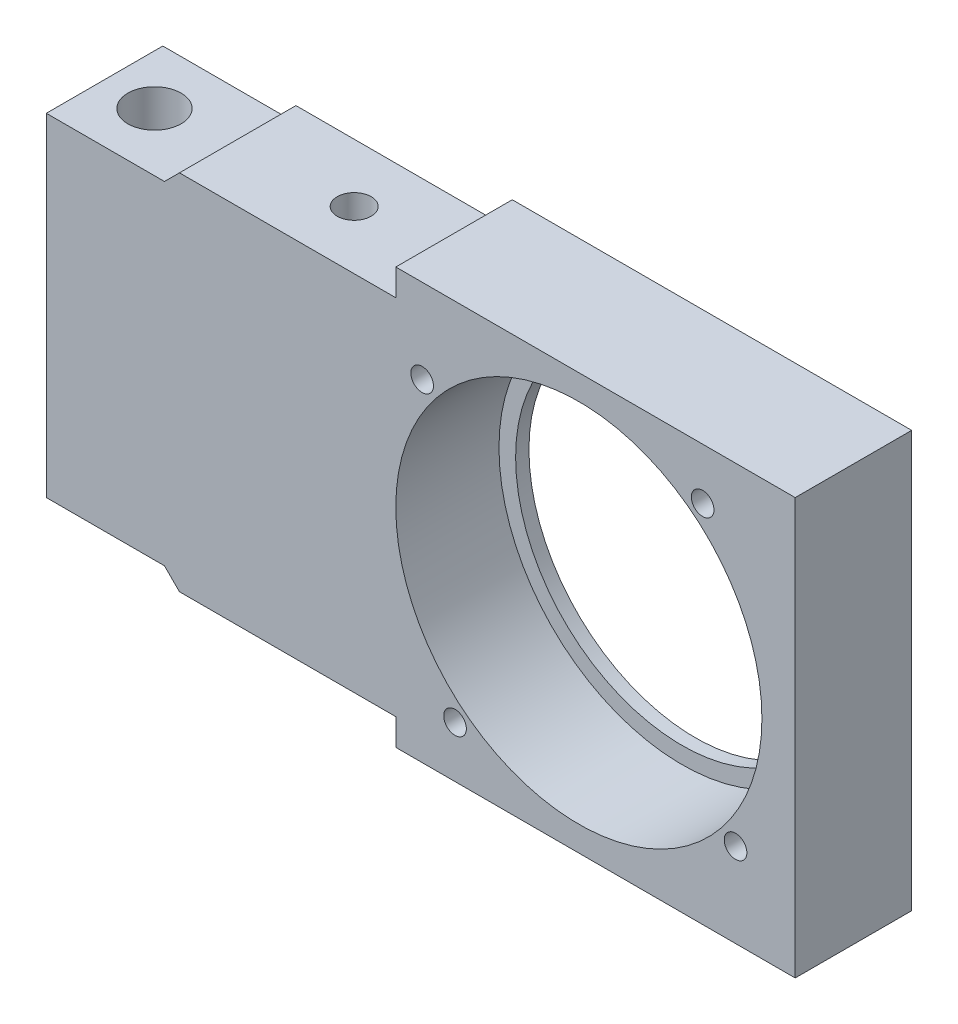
ISO-10303-21;
HEADER;
FILE_DESCRIPTION(('STEP AP214'),'2;1');
FILE_NAME('part.step','',(''),(''),'','','');
FILE_SCHEMA(('AUTOMOTIVE_DESIGN { 1 0 10303 214 1 1 1 1 }'));
ENDSEC;
DATA;
#1=APPLICATION_CONTEXT('core data for automotive mechanical design processes');
#2=APPLICATION_PROTOCOL_DEFINITION('international standard','automotive_design',2000,#1);
#3=PRODUCT_CONTEXT('',#1,'mechanical');
#4=PRODUCT('Part','Part','',(#3));
#5=PRODUCT_RELATED_PRODUCT_CATEGORY('part','',(#4));
#6=PRODUCT_DEFINITION_FORMATION('','',#4);
#7=PRODUCT_DEFINITION_CONTEXT('part definition',#1,'design');
#8=PRODUCT_DEFINITION('design','',#6,#7);
#9=PRODUCT_DEFINITION_SHAPE('','',#8);
#10=(LENGTH_UNIT() NAMED_UNIT(*) SI_UNIT(.MILLI.,.METRE.));
#11=(NAMED_UNIT(*) PLANE_ANGLE_UNIT() SI_UNIT($,.RADIAN.));
#12=(NAMED_UNIT(*) SI_UNIT($,.STERADIAN.) SOLID_ANGLE_UNIT());
#13=UNCERTAINTY_MEASURE_WITH_UNIT(LENGTH_MEASURE(1.E-05),#10,'distance_accuracy_value','');
#14=(GEOMETRIC_REPRESENTATION_CONTEXT(3) GLOBAL_UNCERTAINTY_ASSIGNED_CONTEXT((#13)) GLOBAL_UNIT_ASSIGNED_CONTEXT((#10,
#11,#12)) REPRESENTATION_CONTEXT('',''));
#15=CARTESIAN_POINT('',(0.,0.,0.));
#16=DIRECTION('',(0.,0.,1.));
#17=DIRECTION('',(1.,0.,0.));
#18=AXIS2_PLACEMENT_3D('',#15,#16,#17);
#19=CARTESIAN_POINT('',(-174.5,1.66533453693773E-13,17.5));
#20=DIRECTION('',(0.,0.,1.));
#21=DIRECTION('',(1.,0.,0.));
#22=AXIS2_PLACEMENT_3D('',#19,#20,#21);
#23=PLANE('',#22);
#24=CARTESIAN_POINT('',(37.195451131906,47.0797027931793,17.5));
#25=DIRECTION('',(0.,0.,1.));
#26=DIRECTION('',(1.,0.,0.));
#27=AXIS2_PLACEMENT_3D('',#24,#25,#26);
#28=CIRCLE('',#27,3.39999999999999);
#29=CARTESIAN_POINT('',(40.595451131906,47.0797027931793,17.5));
#30=VERTEX_POINT('',#29);
#31=EDGE_CURVE('E147',#30,#30,#28,.T.);
#32=ORIENTED_EDGE('',*,*,#31,.F.);
#33=EDGE_LOOP('',(#32));
#34=FACE_BOUND('',#33,.T.);
#35=CARTESIAN_POINT('',(47.0797027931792,-37.1954511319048,17.5));
#36=DIRECTION('',(0.,0.,1.));
#37=DIRECTION('',(1.,0.,0.));
#38=AXIS2_PLACEMENT_3D('',#35,#36,#37);
#39=CIRCLE('',#38,3.39999999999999);
#40=CARTESIAN_POINT('',(50.4797027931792,-37.1954511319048,17.5));
#41=VERTEX_POINT('',#40);
#42=EDGE_CURVE('E155',#41,#41,#39,.T.);
#43=ORIENTED_EDGE('',*,*,#42,.F.);
#44=EDGE_LOOP('',(#43));
#45=FACE_BOUND('',#44,.T.);
#46=CARTESIAN_POINT('',(-37.1954511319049,-47.079702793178,17.5));
#47=DIRECTION('',(0.,0.,1.));
#48=DIRECTION('',(1.,0.,0.));
#49=AXIS2_PLACEMENT_3D('',#46,#47,#48);
#50=CIRCLE('',#49,3.39999999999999);
#51=CARTESIAN_POINT('',(-33.7954511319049,-47.079702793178,17.5));
#52=VERTEX_POINT('',#51);
#53=EDGE_CURVE('E161',#52,#52,#50,.T.);
#54=ORIENTED_EDGE('',*,*,#53,.F.);
#55=EDGE_LOOP('',(#54));
#56=FACE_BOUND('',#55,.T.);
#57=CARTESIAN_POINT('',(-47.0797027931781,37.1954511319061,17.5));
#58=DIRECTION('',(0.,0.,1.));
#59=DIRECTION('',(1.,0.,0.));
#60=AXIS2_PLACEMENT_3D('',#57,#58,#59);
#61=CIRCLE('',#60,3.39999999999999);
#62=CARTESIAN_POINT('',(-43.6797027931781,37.1954511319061,17.5));
#63=VERTEX_POINT('',#62);
#64=EDGE_CURVE('E167',#63,#63,#61,.T.);
#65=ORIENTED_EDGE('',*,*,#64,.F.);
#66=EDGE_LOOP('',(#65));
#67=FACE_BOUND('',#66,.T.);
#68=DIRECTION('',(0.707106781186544,-0.707106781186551,0.));
#69=VECTOR('',#68,1.);
#70=CARTESIAN_POINT('',(-120.,-54.5,17.5));
#71=LINE('',#70,#69);
#72=CARTESIAN_POINT('',(-124.5,-50.,17.5));
#73=VERTEX_POINT('',#72);
#74=CARTESIAN_POINT('',(-120.,-54.5,17.5));
#75=VERTEX_POINT('',#74);
#76=EDGE_CURVE('E212',#73,#75,#71,.T.);
#77=ORIENTED_EDGE('',*,*,#76,.T.);
#78=DIRECTION('',(1.,0.,0.));
#79=VECTOR('',#78,1.);
#80=CARTESIAN_POINT('',(-55.,-54.5,17.5));
#81=LINE('',#80,#79);
#82=CARTESIAN_POINT('',(-55.,-54.5,17.5));
#83=VERTEX_POINT('',#82);
#84=EDGE_CURVE('E214',#75,#83,#81,.T.);
#85=ORIENTED_EDGE('',*,*,#84,.T.);
#86=DIRECTION('',(0.,-1.,0.));
#87=VECTOR('',#86,1.);
#88=CARTESIAN_POINT('',(-55.,-62.5,17.5));
#89=LINE('',#88,#87);
#90=CARTESIAN_POINT('',(-55.,-62.5,17.5));
#91=VERTEX_POINT('',#90);
#92=EDGE_CURVE('E216',#83,#91,#89,.T.);
#93=ORIENTED_EDGE('',*,*,#92,.T.);
#94=DIRECTION('',(1.,0.,0.));
#95=VECTOR('',#94,1.);
#96=CARTESIAN_POINT('',(65.,-62.5,17.5));
#97=LINE('',#96,#95);
#98=CARTESIAN_POINT('',(65.,-62.5,17.5));
#99=VERTEX_POINT('',#98);
#100=EDGE_CURVE('E218',#91,#99,#97,.T.);
#101=ORIENTED_EDGE('',*,*,#100,.T.);
#102=DIRECTION('',(0.,1.,0.));
#103=VECTOR('',#102,1.);
#104=CARTESIAN_POINT('',(65.,-62.5,17.5));
#105=LINE('',#104,#103);
#106=CARTESIAN_POINT('',(65.,62.5,17.5));
#107=VERTEX_POINT('',#106);
#108=EDGE_CURVE('E220',#99,#107,#105,.T.);
#109=ORIENTED_EDGE('',*,*,#108,.T.);
#110=DIRECTION('',(-1.,0.,0.));
#111=VECTOR('',#110,1.);
#112=CARTESIAN_POINT('',(65.,62.5,17.5));
#113=LINE('',#112,#111);
#114=CARTESIAN_POINT('',(-55.,62.5,17.5));
#115=VERTEX_POINT('',#114);
#116=EDGE_CURVE('E222',#107,#115,#113,.T.);
#117=ORIENTED_EDGE('',*,*,#116,.T.);
#118=DIRECTION('',(0.,-1.,0.));
#119=VECTOR('',#118,1.);
#120=CARTESIAN_POINT('',(-55.,62.5,17.5));
#121=LINE('',#120,#119);
#122=CARTESIAN_POINT('',(-55.,54.5,17.5));
#123=VERTEX_POINT('',#122);
#124=EDGE_CURVE('E224',#115,#123,#121,.T.);
#125=ORIENTED_EDGE('',*,*,#124,.T.);
#126=DIRECTION('',(-1.,0.,0.));
#127=VECTOR('',#126,1.);
#128=CARTESIAN_POINT('',(-55.,54.5,17.5));
#129=LINE('',#128,#127);
#130=CARTESIAN_POINT('',(-120.,54.5,17.5));
#131=VERTEX_POINT('',#130);
#132=EDGE_CURVE('E226',#123,#131,#129,.T.);
#133=ORIENTED_EDGE('',*,*,#132,.T.);
#134=DIRECTION('',(-0.707106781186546,-0.707106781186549,0.));
#135=VECTOR('',#134,1.);
#136=CARTESIAN_POINT('',(-120.,54.5,17.5));
#137=LINE('',#136,#135);
#138=CARTESIAN_POINT('',(-124.5,50.,17.5));
#139=VERTEX_POINT('',#138);
#140=EDGE_CURVE('E228',#131,#139,#137,.T.);
#141=ORIENTED_EDGE('',*,*,#140,.T.);
#142=DIRECTION('',(-1.,0.,0.));
#143=VECTOR('',#142,1.);
#144=CARTESIAN_POINT('',(-124.5,50.,17.5));
#145=LINE('',#144,#143);
#146=CARTESIAN_POINT('',(-160.,50.,17.5));
#147=VERTEX_POINT('',#146);
#148=EDGE_CURVE('E230',#139,#147,#145,.T.);
#149=ORIENTED_EDGE('',*,*,#148,.T.);
#150=DIRECTION('',(0.,-1.,0.));
#151=VECTOR('',#150,1.);
#152=CARTESIAN_POINT('',(-160.,50.,17.5));
#153=LINE('',#152,#151);
#154=CARTESIAN_POINT('',(-160.,-50.,17.5));
#155=VERTEX_POINT('',#154);
#156=EDGE_CURVE('E56',#147,#155,#153,.T.);
#157=ORIENTED_EDGE('',*,*,#156,.T.);
#158=DIRECTION('',(1.,0.,0.));
#159=VECTOR('',#158,1.);
#160=CARTESIAN_POINT('',(-124.5,-50.,17.5));
#161=LINE('',#160,#159);
#162=EDGE_CURVE('E51',#155,#73,#161,.T.);
#163=ORIENTED_EDGE('',*,*,#162,.T.);
#164=EDGE_LOOP('',(#77,#85,#93,#101,#109,#117,#125,#133,#141,#149,#157,#163));
#165=FACE_BOUND('',#164,.T.);
#166=CARTESIAN_POINT('',(0.,0.,17.5));
#167=DIRECTION('',(0.,0.,1.));
#168=DIRECTION('',(1.,0.,0.));
#169=AXIS2_PLACEMENT_3D('',#166,#167,#168);
#170=CIRCLE('',#169,55.);
#171=CARTESIAN_POINT('',(55.,0.,17.5));
#172=VERTEX_POINT('',#171);
#173=EDGE_CURVE('E190',#172,#172,#170,.F.);
#174=ORIENTED_EDGE('',*,*,#173,.T.);
#175=EDGE_LOOP('',(#174));
#176=FACE_BOUND('',#175,.T.);
#177=ADVANCED_FACE('F34',(#34,#45,#56,#67,#165,#176),#23,.T.);
#178=CARTESIAN_POINT('',(-174.5,1.66533453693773E-13,-17.5));
#179=DIRECTION('',(0.,0.,1.));
#180=DIRECTION('',(1.,0.,0.));
#181=AXIS2_PLACEMENT_3D('',#178,#179,#180);
#182=PLANE('',#181);
#183=DIRECTION('',(0.707106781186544,-0.707106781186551,0.));
#184=VECTOR('',#183,1.);
#185=CARTESIAN_POINT('',(-120.,-54.5,-17.5));
#186=LINE('',#185,#184);
#187=CARTESIAN_POINT('',(-124.5,-50.,-17.5));
#188=VERTEX_POINT('',#187);
#189=CARTESIAN_POINT('',(-120.,-54.5,-17.5));
#190=VERTEX_POINT('',#189);
#191=EDGE_CURVE('E186',#188,#190,#186,.T.);
#192=ORIENTED_EDGE('',*,*,#191,.F.);
#193=DIRECTION('',(1.,0.,0.));
#194=VECTOR('',#193,1.);
#195=CARTESIAN_POINT('',(-124.5,-50.,-17.5));
#196=LINE('',#195,#194);
#197=CARTESIAN_POINT('',(-160.,-50.,-17.5));
#198=VERTEX_POINT('',#197);
#199=EDGE_CURVE('E210',#198,#188,#196,.T.);
#200=ORIENTED_EDGE('',*,*,#199,.F.);
#201=DIRECTION('',(0.,-1.,0.));
#202=VECTOR('',#201,1.);
#203=CARTESIAN_POINT('',(-160.,50.,-17.5));
#204=LINE('',#203,#202);
#205=CARTESIAN_POINT('',(-160.,50.,-17.5));
#206=VERTEX_POINT('',#205);
#207=EDGE_CURVE('E208',#206,#198,#204,.T.);
#208=ORIENTED_EDGE('',*,*,#207,.F.);
#209=DIRECTION('',(-1.,0.,0.));
#210=VECTOR('',#209,1.);
#211=CARTESIAN_POINT('',(-124.5,50.,-17.5));
#212=LINE('',#211,#210);
#213=CARTESIAN_POINT('',(-124.5,50.,-17.5));
#214=VERTEX_POINT('',#213);
#215=EDGE_CURVE('E206',#214,#206,#212,.T.);
#216=ORIENTED_EDGE('',*,*,#215,.F.);
#217=DIRECTION('',(-0.707106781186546,-0.707106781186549,0.));
#218=VECTOR('',#217,1.);
#219=CARTESIAN_POINT('',(-120.,54.5,-17.5));
#220=LINE('',#219,#218);
#221=CARTESIAN_POINT('',(-120.,54.5,-17.5));
#222=VERTEX_POINT('',#221);
#223=EDGE_CURVE('E204',#222,#214,#220,.T.);
#224=ORIENTED_EDGE('',*,*,#223,.F.);
#225=DIRECTION('',(-1.,0.,0.));
#226=VECTOR('',#225,1.);
#227=CARTESIAN_POINT('',(-55.,54.5,-17.5));
#228=LINE('',#227,#226);
#229=CARTESIAN_POINT('',(-55.,54.5,-17.5));
#230=VERTEX_POINT('',#229);
#231=EDGE_CURVE('E202',#230,#222,#228,.T.);
#232=ORIENTED_EDGE('',*,*,#231,.F.);
#233=DIRECTION('',(0.,-1.,0.));
#234=VECTOR('',#233,1.);
#235=CARTESIAN_POINT('',(-55.,62.5,-17.5));
#236=LINE('',#235,#234);
#237=CARTESIAN_POINT('',(-55.,62.5,-17.5));
#238=VERTEX_POINT('',#237);
#239=EDGE_CURVE('E200',#238,#230,#236,.T.);
#240=ORIENTED_EDGE('',*,*,#239,.F.);
#241=DIRECTION('',(-1.,0.,0.));
#242=VECTOR('',#241,1.);
#243=CARTESIAN_POINT('',(65.,62.5,-17.5));
#244=LINE('',#243,#242);
#245=CARTESIAN_POINT('',(65.,62.5,-17.5));
#246=VERTEX_POINT('',#245);
#247=EDGE_CURVE('E198',#246,#238,#244,.T.);
#248=ORIENTED_EDGE('',*,*,#247,.F.);
#249=DIRECTION('',(0.,1.,0.));
#250=VECTOR('',#249,1.);
#251=CARTESIAN_POINT('',(65.,-62.5,-17.5));
#252=LINE('',#251,#250);
#253=CARTESIAN_POINT('',(65.,-62.5,-17.5));
#254=VERTEX_POINT('',#253);
#255=EDGE_CURVE('E196',#254,#246,#252,.T.);
#256=ORIENTED_EDGE('',*,*,#255,.F.);
#257=DIRECTION('',(1.,0.,0.));
#258=VECTOR('',#257,1.);
#259=CARTESIAN_POINT('',(65.,-62.5,-17.5));
#260=LINE('',#259,#258);
#261=CARTESIAN_POINT('',(-55.,-62.5,-17.5));
#262=VERTEX_POINT('',#261);
#263=EDGE_CURVE('E194',#262,#254,#260,.T.);
#264=ORIENTED_EDGE('',*,*,#263,.F.);
#265=DIRECTION('',(0.,-1.,0.));
#266=VECTOR('',#265,1.);
#267=CARTESIAN_POINT('',(-55.,-62.5,-17.5));
#268=LINE('',#267,#266);
#269=CARTESIAN_POINT('',(-55.,-54.5,-17.5));
#270=VERTEX_POINT('',#269);
#271=EDGE_CURVE('E192',#270,#262,#268,.T.);
#272=ORIENTED_EDGE('',*,*,#271,.F.);
#273=DIRECTION('',(1.,0.,0.));
#274=VECTOR('',#273,1.);
#275=CARTESIAN_POINT('',(-55.,-54.5,-17.5));
#276=LINE('',#275,#274);
#277=EDGE_CURVE('E189',#190,#270,#276,.T.);
#278=ORIENTED_EDGE('',*,*,#277,.F.);
#279=EDGE_LOOP('',(#192,#200,#208,#216,#224,#232,#240,#248,#256,#264,#272,#278));
#280=FACE_BOUND('',#279,.T.);
#281=CARTESIAN_POINT('',(0.,0.,-17.5));
#282=DIRECTION('',(0.,0.,1.));
#283=DIRECTION('',(1.,0.,0.));
#284=AXIS2_PLACEMENT_3D('',#281,#282,#283);
#285=CIRCLE('',#284,50.);
#286=CARTESIAN_POINT('',(50.,0.,-17.5));
#287=VERTEX_POINT('',#286);
#288=EDGE_CURVE('E185',#287,#287,#285,.F.);
#289=ORIENTED_EDGE('',*,*,#288,.F.);
#290=EDGE_LOOP('',(#289));
#291=FACE_BOUND('',#290,.T.);
#292=ADVANCED_FACE('F291',(#280,#291),#182,.F.);
#293=CARTESIAN_POINT('',(-120.,-54.5,17.5));
#294=DIRECTION('',(0.707106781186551,0.707106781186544,0.));
#295=DIRECTION('',(-0.707106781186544,0.707106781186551,0.));
#296=AXIS2_PLACEMENT_3D('',#293,#294,#295);
#297=PLANE('',#296);
#298=ORIENTED_EDGE('',*,*,#191,.T.);
#299=DIRECTION('',(0.,0.,-1.));
#300=VECTOR('',#299,1.);
#301=CARTESIAN_POINT('',(-120.,-54.5,17.5));
#302=LINE('',#301,#300);
#303=EDGE_CURVE('E11',#75,#190,#302,.T.);
#304=ORIENTED_EDGE('',*,*,#303,.F.);
#305=ORIENTED_EDGE('',*,*,#76,.F.);
#306=DIRECTION('',(0.,0.,-1.));
#307=VECTOR('',#306,1.);
#308=CARTESIAN_POINT('',(-124.5,-50.,17.5));
#309=LINE('',#308,#307);
#310=EDGE_CURVE('E234',#73,#188,#309,.T.);
#311=ORIENTED_EDGE('',*,*,#310,.T.);
#312=EDGE_LOOP('',(#298,#304,#305,#311));
#313=FACE_BOUND('',#312,.T.);
#314=ADVANCED_FACE('F36',(#313),#297,.F.);
#315=CARTESIAN_POINT('',(-55.,-54.5,17.5));
#316=DIRECTION('',(0.,1.,0.));
#317=DIRECTION('',(-1.,0.,0.));
#318=AXIS2_PLACEMENT_3D('',#315,#316,#317);
#319=PLANE('',#318);
#320=ORIENTED_EDGE('',*,*,#277,.T.);
#321=DIRECTION('',(0.,0.,-1.));
#322=VECTOR('',#321,1.);
#323=CARTESIAN_POINT('',(-55.,-54.5,17.5));
#324=LINE('',#323,#322);
#325=EDGE_CURVE('E43',#83,#270,#324,.T.);
#326=ORIENTED_EDGE('',*,*,#325,.F.);
#327=ORIENTED_EDGE('',*,*,#84,.F.);
#328=ORIENTED_EDGE('',*,*,#303,.T.);
#329=EDGE_LOOP('',(#320,#326,#327,#328));
#330=FACE_BOUND('',#329,.T.);
#331=ADVANCED_FACE('F340',(#330),#319,.F.);
#332=CARTESIAN_POINT('',(-55.,-62.5,17.5));
#333=DIRECTION('',(1.,0.,0.));
#334=DIRECTION('',(0.,1.,0.));
#335=AXIS2_PLACEMENT_3D('',#332,#333,#334);
#336=PLANE('',#335);
#337=ORIENTED_EDGE('',*,*,#271,.T.);
#338=DIRECTION('',(0.,0.,-1.));
#339=VECTOR('',#338,1.);
#340=CARTESIAN_POINT('',(-55.,-62.5,17.5));
#341=LINE('',#340,#339);
#342=EDGE_CURVE('E261',#91,#262,#341,.T.);
#343=ORIENTED_EDGE('',*,*,#342,.F.);
#344=ORIENTED_EDGE('',*,*,#92,.F.);
#345=ORIENTED_EDGE('',*,*,#325,.T.);
#346=EDGE_LOOP('',(#337,#343,#344,#345));
#347=FACE_BOUND('',#346,.T.);
#348=ADVANCED_FACE('F337',(#347),#336,.F.);
#349=CARTESIAN_POINT('',(65.,-62.5,17.5));
#350=DIRECTION('',(0.,1.,0.));
#351=DIRECTION('',(-1.,0.,0.));
#352=AXIS2_PLACEMENT_3D('',#349,#350,#351);
#353=PLANE('',#352);
#354=ORIENTED_EDGE('',*,*,#263,.T.);
#355=DIRECTION('',(0.,0.,-1.));
#356=VECTOR('',#355,1.);
#357=CARTESIAN_POINT('',(65.,-62.5,17.5));
#358=LINE('',#357,#356);
#359=EDGE_CURVE('E258',#99,#254,#358,.T.);
#360=ORIENTED_EDGE('',*,*,#359,.F.);
#361=ORIENTED_EDGE('',*,*,#100,.F.);
#362=ORIENTED_EDGE('',*,*,#342,.T.);
#363=EDGE_LOOP('',(#354,#360,#361,#362));
#364=FACE_BOUND('',#363,.T.);
#365=ADVANCED_FACE('F333',(#364),#353,.F.);
#366=CARTESIAN_POINT('',(65.,-62.5,17.5));
#367=DIRECTION('',(-1.,0.,0.));
#368=DIRECTION('',(0.,0.,1.));
#369=AXIS2_PLACEMENT_3D('',#366,#367,#368);
#370=PLANE('',#369);
#371=ORIENTED_EDGE('',*,*,#255,.T.);
#372=DIRECTION('',(0.,0.,-1.));
#373=VECTOR('',#372,1.);
#374=CARTESIAN_POINT('',(65.,62.5,17.5));
#375=LINE('',#374,#373);
#376=EDGE_CURVE('E255',#107,#246,#375,.T.);
#377=ORIENTED_EDGE('',*,*,#376,.F.);
#378=ORIENTED_EDGE('',*,*,#108,.F.);
#379=ORIENTED_EDGE('',*,*,#359,.T.);
#380=EDGE_LOOP('',(#371,#377,#378,#379));
#381=FACE_BOUND('',#380,.T.);
#382=ADVANCED_FACE('F329',(#381),#370,.F.);
#383=CARTESIAN_POINT('',(65.,62.5,17.5));
#384=DIRECTION('',(0.,-1.,0.));
#385=DIRECTION('',(1.,0.,0.));
#386=AXIS2_PLACEMENT_3D('',#383,#384,#385);
#387=PLANE('',#386);
#388=ORIENTED_EDGE('',*,*,#247,.T.);
#389=DIRECTION('',(0.,0.,-1.));
#390=VECTOR('',#389,1.);
#391=CARTESIAN_POINT('',(-55.,62.5,17.5));
#392=LINE('',#391,#390);
#393=EDGE_CURVE('E252',#115,#238,#392,.T.);
#394=ORIENTED_EDGE('',*,*,#393,.F.);
#395=ORIENTED_EDGE('',*,*,#116,.F.);
#396=ORIENTED_EDGE('',*,*,#376,.T.);
#397=EDGE_LOOP('',(#388,#394,#395,#396));
#398=FACE_BOUND('',#397,.T.);
#399=ADVANCED_FACE('F325',(#398),#387,.F.);
#400=CARTESIAN_POINT('',(-55.,62.5,17.5));
#401=DIRECTION('',(1.,0.,0.));
#402=DIRECTION('',(0.,1.,0.));
#403=AXIS2_PLACEMENT_3D('',#400,#401,#402);
#404=PLANE('',#403);
#405=ORIENTED_EDGE('',*,*,#239,.T.);
#406=DIRECTION('',(0.,0.,-1.));
#407=VECTOR('',#406,1.);
#408=CARTESIAN_POINT('',(-55.,54.5,17.5));
#409=LINE('',#408,#407);
#410=EDGE_CURVE('E249',#123,#230,#409,.T.);
#411=ORIENTED_EDGE('',*,*,#410,.F.);
#412=ORIENTED_EDGE('',*,*,#124,.F.);
#413=ORIENTED_EDGE('',*,*,#393,.T.);
#414=EDGE_LOOP('',(#405,#411,#412,#413));
#415=FACE_BOUND('',#414,.T.);
#416=ADVANCED_FACE('F321',(#415),#404,.F.);
#417=CARTESIAN_POINT('',(-55.,54.5,17.5));
#418=DIRECTION('',(0.,-1.,0.));
#419=DIRECTION('',(1.,0.,0.));
#420=AXIS2_PLACEMENT_3D('',#417,#418,#419);
#421=PLANE('',#420);
#422=CARTESIAN_POINT('',(-85.,54.5,0.));
#423=DIRECTION('',(0.,1.,0.));
#424=DIRECTION('',(0.,0.,1.));
#425=AXIS2_PLACEMENT_3D('',#422,#423,#424);
#426=CIRCLE('',#425,5.09999999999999);
#427=CARTESIAN_POINT('',(-85.,54.5,5.09999999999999));
#428=VERTEX_POINT('',#427);
#429=EDGE_CURVE('E176',#428,#428,#426,.T.);
#430=ORIENTED_EDGE('',*,*,#429,.F.);
#431=EDGE_LOOP('',(#430));
#432=FACE_BOUND('',#431,.T.);
#433=ORIENTED_EDGE('',*,*,#231,.T.);
#434=DIRECTION('',(0.,0.,-1.));
#435=VECTOR('',#434,1.);
#436=CARTESIAN_POINT('',(-120.,54.5,17.5));
#437=LINE('',#436,#435);
#438=EDGE_CURVE('E246',#131,#222,#437,.T.);
#439=ORIENTED_EDGE('',*,*,#438,.F.);
#440=ORIENTED_EDGE('',*,*,#132,.F.);
#441=ORIENTED_EDGE('',*,*,#410,.T.);
#442=EDGE_LOOP('',(#433,#439,#440,#441));
#443=FACE_BOUND('',#442,.T.);
#444=ADVANCED_FACE('F317',(#432,#443),#421,.F.);
#445=CARTESIAN_POINT('',(-120.,54.5,17.5));
#446=DIRECTION('',(0.707106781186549,-0.707106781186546,0.));
#447=DIRECTION('',(0.707106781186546,0.707106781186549,0.));
#448=AXIS2_PLACEMENT_3D('',#445,#446,#447);
#449=PLANE('',#448);
#450=ORIENTED_EDGE('',*,*,#223,.T.);
#451=DIRECTION('',(0.,0.,-1.));
#452=VECTOR('',#451,1.);
#453=CARTESIAN_POINT('',(-124.5,50.,17.5));
#454=LINE('',#453,#452);
#455=EDGE_CURVE('E243',#139,#214,#454,.T.);
#456=ORIENTED_EDGE('',*,*,#455,.F.);
#457=ORIENTED_EDGE('',*,*,#140,.F.);
#458=ORIENTED_EDGE('',*,*,#438,.T.);
#459=EDGE_LOOP('',(#450,#456,#457,#458));
#460=FACE_BOUND('',#459,.T.);
#461=ADVANCED_FACE('F313',(#460),#449,.F.);
#462=CARTESIAN_POINT('',(-124.5,50.,17.5));
#463=DIRECTION('',(0.,-1.,0.));
#464=DIRECTION('',(1.,0.,0.));
#465=AXIS2_PLACEMENT_3D('',#462,#463,#464);
#466=PLANE('',#465);
#467=CARTESIAN_POINT('',(-145.,50.,0.));
#468=DIRECTION('',(0.,-1.,0.));
#469=DIRECTION('',(1.,0.,0.));
#470=AXIS2_PLACEMENT_3D('',#467,#468,#469);
#471=CIRCLE('',#470,8.00000000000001);
#472=CARTESIAN_POINT('',(-137.,50.,0.));
#473=VERTEX_POINT('',#472);
#474=EDGE_CURVE('E170',#473,#473,#471,.T.);
#475=ORIENTED_EDGE('',*,*,#474,.T.);
#476=EDGE_LOOP('',(#475));
#477=FACE_BOUND('',#476,.T.);
#478=ORIENTED_EDGE('',*,*,#215,.T.);
#479=DIRECTION('',(0.,0.,-1.));
#480=VECTOR('',#479,1.);
#481=CARTESIAN_POINT('',(-160.,50.,17.5));
#482=LINE('',#481,#480);
#483=EDGE_CURVE('E240',#147,#206,#482,.T.);
#484=ORIENTED_EDGE('',*,*,#483,.F.);
#485=ORIENTED_EDGE('',*,*,#148,.F.);
#486=ORIENTED_EDGE('',*,*,#455,.T.);
#487=EDGE_LOOP('',(#478,#484,#485,#486));
#488=FACE_BOUND('',#487,.T.);
#489=ADVANCED_FACE('F309',(#477,#488),#466,.F.);
#490=CARTESIAN_POINT('',(-160.,50.,17.5));
#491=DIRECTION('',(1.,0.,0.));
#492=DIRECTION('',(0.,0.,-1.));
#493=AXIS2_PLACEMENT_3D('',#490,#491,#492);
#494=PLANE('',#493);
#495=ORIENTED_EDGE('',*,*,#207,.T.);
#496=DIRECTION('',(0.,0.,-1.));
#497=VECTOR('',#496,1.);
#498=CARTESIAN_POINT('',(-160.,-50.,17.5));
#499=LINE('',#498,#497);
#500=EDGE_CURVE('E237',#155,#198,#499,.T.);
#501=ORIENTED_EDGE('',*,*,#500,.F.);
#502=ORIENTED_EDGE('',*,*,#156,.F.);
#503=ORIENTED_EDGE('',*,*,#483,.T.);
#504=EDGE_LOOP('',(#495,#501,#502,#503));
#505=FACE_BOUND('',#504,.T.);
#506=ADVANCED_FACE('F305',(#505),#494,.F.);
#507=CARTESIAN_POINT('',(-124.5,-50.,17.5));
#508=DIRECTION('',(0.,1.,0.));
#509=DIRECTION('',(-1.,0.,0.));
#510=AXIS2_PLACEMENT_3D('',#507,#508,#509);
#511=PLANE('',#510);
#512=CARTESIAN_POINT('',(-145.,-50.,0.));
#513=DIRECTION('',(0.,1.,0.));
#514=DIRECTION('',(-1.,0.,0.));
#515=AXIS2_PLACEMENT_3D('',#512,#513,#514);
#516=CIRCLE('',#515,8.00000000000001);
#517=CARTESIAN_POINT('',(-153.,-50.,0.));
#518=VERTEX_POINT('',#517);
#519=EDGE_CURVE('E38',#518,#518,#516,.T.);
#520=ORIENTED_EDGE('',*,*,#519,.T.);
#521=EDGE_LOOP('',(#520));
#522=FACE_BOUND('',#521,.T.);
#523=ORIENTED_EDGE('',*,*,#199,.T.);
#524=ORIENTED_EDGE('',*,*,#310,.F.);
#525=ORIENTED_EDGE('',*,*,#162,.F.);
#526=ORIENTED_EDGE('',*,*,#500,.T.);
#527=EDGE_LOOP('',(#523,#524,#525,#526));
#528=FACE_BOUND('',#527,.T.);
#529=ADVANCED_FACE('F302',(#522,#528),#511,.F.);
#530=CARTESIAN_POINT('',(0.,0.,-39.9159663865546));
#531=DIRECTION('',(0.,0.,-1.));
#532=DIRECTION('',(-1.,0.,0.));
#533=AXIS2_PLACEMENT_3D('',#530,#531,#532);
#534=CYLINDRICAL_SURFACE('',#533,50.);
#535=CARTESIAN_POINT('',(0.,0.,-13.5));
#536=DIRECTION('',(0.,0.,-1.));
#537=DIRECTION('',(-1.,0.,0.));
#538=AXIS2_PLACEMENT_3D('',#535,#536,#537);
#539=CIRCLE('',#538,50.);
#540=CARTESIAN_POINT('',(-50.,0.,-13.5));
#541=VERTEX_POINT('',#540);
#542=EDGE_CURVE('E179',#541,#541,#539,.T.);
#543=ORIENTED_EDGE('',*,*,#542,.F.);
#544=EDGE_LOOP('',(#543));
#545=FACE_BOUND('',#544,.T.);
#546=ORIENTED_EDGE('',*,*,#288,.T.);
#547=EDGE_LOOP('',(#546));
#548=FACE_BOUND('',#547,.T.);
#549=ADVANCED_FACE('F275',(#545,#548),#534,.F.);
#550=CARTESIAN_POINT('',(0.,0.,-39.9159663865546));
#551=DIRECTION('',(0.,0.,-1.));
#552=DIRECTION('',(-1.,0.,0.));
#553=AXIS2_PLACEMENT_3D('',#550,#551,#552);
#554=CYLINDRICAL_SURFACE('',#553,55.);
#555=ORIENTED_EDGE('',*,*,#173,.F.);
#556=EDGE_LOOP('',(#555));
#557=FACE_BOUND('',#556,.T.);
#558=CARTESIAN_POINT('',(0.,0.,-13.5));
#559=DIRECTION('',(0.,0.,-1.));
#560=DIRECTION('',(-1.,0.,0.));
#561=AXIS2_PLACEMENT_3D('',#558,#559,#560);
#562=CIRCLE('',#561,55.);
#563=CARTESIAN_POINT('',(-55.,0.,-13.5));
#564=VERTEX_POINT('',#563);
#565=EDGE_CURVE('E182',#564,#564,#562,.T.);
#566=ORIENTED_EDGE('',*,*,#565,.T.);
#567=EDGE_LOOP('',(#566));
#568=FACE_BOUND('',#567,.T.);
#569=ADVANCED_FACE('F271',(#557,#568),#554,.F.);
#570=CARTESIAN_POINT('',(50.,0.,-13.5));
#571=DIRECTION('',(0.,0.,1.));
#572=DIRECTION('',(1.,0.,0.));
#573=AXIS2_PLACEMENT_3D('',#570,#571,#572);
#574=PLANE('',#573);
#575=ORIENTED_EDGE('',*,*,#542,.T.);
#576=EDGE_LOOP('',(#575));
#577=FACE_BOUND('',#576,.T.);
#578=ORIENTED_EDGE('',*,*,#565,.F.);
#579=EDGE_LOOP('',(#578));
#580=FACE_BOUND('',#579,.T.);
#581=ADVANCED_FACE('F274',(#577,#580),#574,.T.);
#582=CARTESIAN_POINT('',(-85.,54.5,0.));
#583=DIRECTION('',(0.,1.,0.));
#584=DIRECTION('',(0.,0.,1.));
#585=AXIS2_PLACEMENT_3D('',#582,#583,#584);
#586=CYLINDRICAL_SURFACE('',#585,5.09999999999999);
#587=CARTESIAN_POINT('',(-85.,21.75,0.));
#588=DIRECTION('',(0.,1.,0.));
#589=DIRECTION('',(0.,0.,1.));
#590=AXIS2_PLACEMENT_3D('',#587,#588,#589);
#591=CIRCLE('',#590,5.09999999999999);
#592=CARTESIAN_POINT('',(-85.,21.75,5.09999999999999));
#593=VERTEX_POINT('',#592);
#594=EDGE_CURVE('E173',#593,#593,#591,.T.);
#595=ORIENTED_EDGE('',*,*,#594,.F.);
#596=EDGE_LOOP('',(#595));
#597=FACE_BOUND('',#596,.T.);
#598=ORIENTED_EDGE('',*,*,#429,.T.);
#599=EDGE_LOOP('',(#598));
#600=FACE_BOUND('',#599,.T.);
#601=ADVANCED_FACE('F280',(#597,#600),#586,.F.);
#602=CARTESIAN_POINT('',(-85.,21.75,0.));
#603=DIRECTION('',(0.,1.,0.));
#604=DIRECTION('',(0.,0.,1.));
#605=AXIS2_PLACEMENT_3D('',#602,#603,#604);
#606=CONICAL_SURFACE('',#605,5.09999999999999,1.02974425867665);
#607=CARTESIAN_POINT('',(-85.,18.6856108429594,0.));
#608=VERTEX_POINT('',#607);
#609=VERTEX_LOOP('',#608);
#610=FACE_BOUND('',#609,.T.);
#611=ORIENTED_EDGE('',*,*,#594,.T.);
#612=EDGE_LOOP('',(#611));
#613=FACE_BOUND('',#612,.T.);
#614=ADVANCED_FACE('F286',(#610,#613),#606,.F.);
#615=CARTESIAN_POINT('',(-145.,-62.5,0.));
#616=DIRECTION('',(0.,1.,0.));
#617=DIRECTION('',(0.,0.,1.));
#618=AXIS2_PLACEMENT_3D('',#615,#616,#617);
#619=CYLINDRICAL_SURFACE('',#618,8.00000000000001);
#620=ORIENTED_EDGE('',*,*,#519,.F.);
#621=EDGE_LOOP('',(#620));
#622=FACE_BOUND('',#621,.T.);
#623=ORIENTED_EDGE('',*,*,#474,.F.);
#624=EDGE_LOOP('',(#623));
#625=FACE_BOUND('',#624,.T.);
#626=ADVANCED_FACE('F392',(#622,#625),#619,.F.);
#627=CARTESIAN_POINT('',(-47.0797027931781,37.1954511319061,17.5));
#628=DIRECTION('',(0.,0.,1.));
#629=DIRECTION('',(1.,0.,0.));
#630=AXIS2_PLACEMENT_3D('',#627,#628,#629);
#631=CYLINDRICAL_SURFACE('',#630,3.39999999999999);
#632=CARTESIAN_POINT('',(-47.0797027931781,37.1954511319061,-4.75));
#633=DIRECTION('',(0.,0.,1.));
#634=DIRECTION('',(1.,0.,0.));
#635=AXIS2_PLACEMENT_3D('',#632,#633,#634);
#636=CIRCLE('',#635,3.39999999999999);
#637=CARTESIAN_POINT('',(-43.6797027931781,37.1954511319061,-4.75));
#638=VERTEX_POINT('',#637);
#639=EDGE_CURVE('E164',#638,#638,#636,.T.);
#640=ORIENTED_EDGE('',*,*,#639,.F.);
#641=EDGE_LOOP('',(#640));
#642=FACE_BOUND('',#641,.T.);
#643=ORIENTED_EDGE('',*,*,#64,.T.);
#644=EDGE_LOOP('',(#643));
#645=FACE_BOUND('',#644,.T.);
#646=ADVANCED_FACE('F396',(#642,#645),#631,.F.);
#647=CARTESIAN_POINT('',(-47.0797027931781,37.1954511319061,-4.75));
#648=DIRECTION('',(0.,0.,1.));
#649=DIRECTION('',(1.,0.,0.));
#650=AXIS2_PLACEMENT_3D('',#647,#648,#649);
#651=CONICAL_SURFACE('',#650,3.39999999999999,1.02974425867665);
#652=CARTESIAN_POINT('',(-47.0797027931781,37.1954511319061,-6.7929261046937));
#653=VERTEX_POINT('',#652);
#654=VERTEX_LOOP('',#653);
#655=FACE_BOUND('',#654,.T.);
#656=ORIENTED_EDGE('',*,*,#639,.T.);
#657=EDGE_LOOP('',(#656));
#658=FACE_BOUND('',#657,.T.);
#659=ADVANCED_FACE('F400',(#655,#658),#651,.F.);
#660=CARTESIAN_POINT('',(-37.1954511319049,-47.079702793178,17.5));
#661=DIRECTION('',(0.,0.,1.));
#662=DIRECTION('',(1.,0.,0.));
#663=AXIS2_PLACEMENT_3D('',#660,#661,#662);
#664=CYLINDRICAL_SURFACE('',#663,3.39999999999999);
#665=CARTESIAN_POINT('',(-37.1954511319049,-47.079702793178,-4.75));
#666=DIRECTION('',(0.,0.,1.));
#667=DIRECTION('',(1.,0.,0.));
#668=AXIS2_PLACEMENT_3D('',#665,#666,#667);
#669=CIRCLE('',#668,3.39999999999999);
#670=CARTESIAN_POINT('',(-33.7954511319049,-47.079702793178,-4.75));
#671=VERTEX_POINT('',#670);
#672=EDGE_CURVE('E158',#671,#671,#669,.T.);
#673=ORIENTED_EDGE('',*,*,#672,.F.);
#674=EDGE_LOOP('',(#673));
#675=FACE_BOUND('',#674,.T.);
#676=ORIENTED_EDGE('',*,*,#53,.T.);
#677=EDGE_LOOP('',(#676));
#678=FACE_BOUND('',#677,.T.);
#679=ADVANCED_FACE('F404',(#675,#678),#664,.F.);
#680=CARTESIAN_POINT('',(-37.1954511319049,-47.079702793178,-4.75));
#681=DIRECTION('',(0.,0.,1.));
#682=DIRECTION('',(1.,0.,0.));
#683=AXIS2_PLACEMENT_3D('',#680,#681,#682);
#684=CONICAL_SURFACE('',#683,3.39999999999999,1.02974425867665);
#685=CARTESIAN_POINT('',(-37.1954511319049,-47.079702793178,-6.7929261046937));
#686=VERTEX_POINT('',#685);
#687=VERTEX_LOOP('',#686);
#688=FACE_BOUND('',#687,.T.);
#689=ORIENTED_EDGE('',*,*,#672,.T.);
#690=EDGE_LOOP('',(#689));
#691=FACE_BOUND('',#690,.T.);
#692=ADVANCED_FACE('F408',(#688,#691),#684,.F.);
#693=CARTESIAN_POINT('',(47.0797027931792,-37.1954511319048,17.5));
#694=DIRECTION('',(0.,0.,1.));
#695=DIRECTION('',(1.,0.,0.));
#696=AXIS2_PLACEMENT_3D('',#693,#694,#695);
#697=CYLINDRICAL_SURFACE('',#696,3.39999999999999);
#698=CARTESIAN_POINT('',(47.0797027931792,-37.1954511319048,-4.75));
#699=DIRECTION('',(0.,0.,1.));
#700=DIRECTION('',(1.,0.,0.));
#701=AXIS2_PLACEMENT_3D('',#698,#699,#700);
#702=CIRCLE('',#701,3.39999999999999);
#703=CARTESIAN_POINT('',(50.4797027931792,-37.1954511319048,-4.75));
#704=VERTEX_POINT('',#703);
#705=EDGE_CURVE('E150',#704,#704,#702,.T.);
#706=ORIENTED_EDGE('',*,*,#705,.F.);
#707=EDGE_LOOP('',(#706));
#708=FACE_BOUND('',#707,.T.);
#709=ORIENTED_EDGE('',*,*,#42,.T.);
#710=EDGE_LOOP('',(#709));
#711=FACE_BOUND('',#710,.T.);
#712=ADVANCED_FACE('F412',(#708,#711),#697,.F.);
#713=CARTESIAN_POINT('',(47.0797027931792,-37.1954511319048,-4.75));
#714=DIRECTION('',(0.,0.,1.));
#715=DIRECTION('',(1.,0.,0.));
#716=AXIS2_PLACEMENT_3D('',#713,#714,#715);
#717=CONICAL_SURFACE('',#716,3.39999999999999,1.02974425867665);
#718=CARTESIAN_POINT('',(47.0797027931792,-37.1954511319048,-6.7929261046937));
#719=VERTEX_POINT('',#718);
#720=VERTEX_LOOP('',#719);
#721=FACE_BOUND('',#720,.T.);
#722=ORIENTED_EDGE('',*,*,#705,.T.);
#723=EDGE_LOOP('',(#722));
#724=FACE_BOUND('',#723,.T.);
#725=ADVANCED_FACE('F416',(#721,#724),#717,.F.);
#726=CARTESIAN_POINT('',(37.195451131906,47.0797027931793,17.5));
#727=DIRECTION('',(0.,0.,1.));
#728=DIRECTION('',(1.,0.,0.));
#729=AXIS2_PLACEMENT_3D('',#726,#727,#728);
#730=CYLINDRICAL_SURFACE('',#729,3.39999999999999);
#731=CARTESIAN_POINT('',(37.195451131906,47.0797027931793,-4.75));
#732=DIRECTION('',(0.,0.,1.));
#733=DIRECTION('',(1.,0.,0.));
#734=AXIS2_PLACEMENT_3D('',#731,#732,#733);
#735=CIRCLE('',#734,3.39999999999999);
#736=CARTESIAN_POINT('',(40.595451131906,47.0797027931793,-4.75));
#737=VERTEX_POINT('',#736);
#738=EDGE_CURVE('E145',#737,#737,#735,.T.);
#739=ORIENTED_EDGE('',*,*,#738,.F.);
#740=EDGE_LOOP('',(#739));
#741=FACE_BOUND('',#740,.T.);
#742=ORIENTED_EDGE('',*,*,#31,.T.);
#743=EDGE_LOOP('',(#742));
#744=FACE_BOUND('',#743,.T.);
#745=ADVANCED_FACE('F141',(#741,#744),#730,.F.);
#746=CARTESIAN_POINT('',(37.195451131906,47.0797027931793,-4.75));
#747=DIRECTION('',(0.,0.,1.));
#748=DIRECTION('',(1.,0.,0.));
#749=AXIS2_PLACEMENT_3D('',#746,#747,#748);
#750=CONICAL_SURFACE('',#749,3.39999999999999,1.02974425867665);
#751=CARTESIAN_POINT('',(37.195451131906,47.0797027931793,-6.7929261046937));
#752=VERTEX_POINT('',#751);
#753=VERTEX_LOOP('',#752);
#754=FACE_BOUND('',#753,.T.);
#755=ORIENTED_EDGE('',*,*,#738,.T.);
#756=EDGE_LOOP('',(#755));
#757=FACE_BOUND('',#756,.T.);
#758=ADVANCED_FACE('F138',(#754,#757),#750,.F.);
#759=CLOSED_SHELL('',(#177,#292,#314,#331,#348,#365,#382,#399,#416,#444,#461,#489,#506,#529,
#549,#569,#581,#601,#614,#626,#646,#659,#679,#692,#712,#725,#745,#758));
#760=MANIFOLD_SOLID_BREP('B2',#759);
#761=ADVANCED_BREP_SHAPE_REPRESENTATION('',(#18,#760),#14);
#762=SHAPE_DEFINITION_REPRESENTATION(#9,#761);
ENDSEC;
END-ISO-10303-21;
